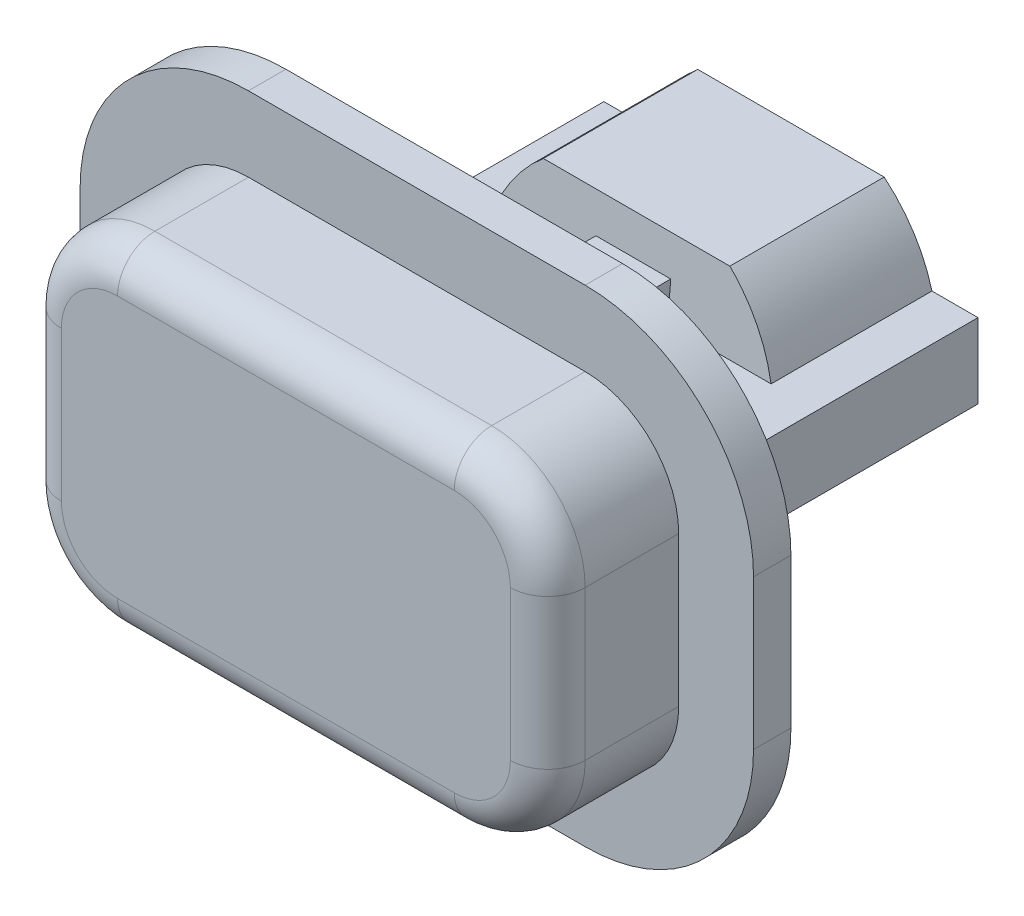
from build123d import *

# Parameters (mm, degrees)
EXTRUDE1_DEPTH     = 3.5
EXTRUDE2_DEPTH     = 1
FILLET1_R          = 1
SKETCH3_W          = 10
SKETCH3_H          = 2
EXTRUDE3_DEPTH     = 9
SKETCH4_W          = 2
SKETCH4_H          = 4
EXTRUDE4_DEPTH     = 9
SKETCH5_R          = 3.9
EXTRUDE5_DEPTH     = 4.3
SKETCH6_R          = 1.9
CUT_EXTRUDE1_DEPTH = 2
DRAFT1_ANGLE       = 5
DRAFT2_ANGLE       = 5
CUT_EXTRUDE2_REACH = 19.479
SKETCH7_W          = 8.421636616
SKETCH7_H          = 1.922330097


with BuildPart() as part:
    # Sketch1 → Extrude1 (new body)
    with BuildSketch(Plane.XY):
        with BuildLine():
            Line((-4.5, 4.5), (4.5, 4.5))
            ThreePointArc((4.5, 4.5), (6.267766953, 3.767766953), (7, 2))
            Line((7, 2), (7, -2))
            ThreePointArc((7, -2), (6.267766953, -3.767766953), (4.5, -4.5))
            Line((4.5, -4.5), (-4.5, -4.5))
            ThreePointArc((-4.5, -4.5), (-6.267766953, -3.767766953), (-7, -2))
            Line((-7, -2), (-7, 2))
            ThreePointArc((-7, 2), (-6.267766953, 3.767766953), (-4.5, 4.5))
        make_face()
    extrude(amount=-EXTRUDE1_DEPTH)

    # Sketch2 → Extrude2 (add)
    with BuildSketch(Plane(origin=(0, 0, -3.5), x_dir=(-1, 0, 0), z_dir=(0, 0, -1))):
        with BuildLine():
            Line((4.5, 6.5), (-4.5, 6.5))
            ThreePointArc((-4.5, 6.5), (-7.681980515, 5.181980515), (-9, 2))
            Line((-9, 2), (-9, -2))
            ThreePointArc((-9, -2), (-7.681980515, -5.181980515), (-4.5, -6.5))
            Line((-4.5, -6.5), (4.5, -6.5))
            ThreePointArc((4.5, -6.5), (7.681980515, -5.181980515), (9, -2))
            Line((9, -2), (9, 2))
            ThreePointArc((9, 2), (7.681980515, 5.181980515), (4.5, 6.5))
        make_face()
    extrude(amount=EXTRUDE2_DEPTH)

    # Fillet1
    fillet1_edges = [part.edges().sort_by_distance(p)[0] for p in [
        (-7, 0, 0),
        (-6.267766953, 3.767766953, 0),
        (0, 4.5, 0),
        (6.267766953, 3.767766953, 0),
        (7, 0, 0),
        (6.267766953, -3.767766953, 0),
        (0, -4.5, 0),
        (-6.267766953, -3.767766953, 0),
    ]]
    fillet(fillet1_edges, radius=FILLET1_R)

    # Sketch3 → Extrude3 (add)
    with BuildSketch(Plane(origin=(0, 0, -4.5), x_dir=(-1, 0, 0), z_dir=(0, 0, -1))):
        Rectangle(SKETCH3_W, SKETCH3_H)
    extrude(amount=EXTRUDE3_DEPTH)

    # Sketch4 → Extrude4 (add)
    with BuildSketch(Plane(origin=(0, 0, -4.5), x_dir=(-1, 0, 0), z_dir=(0, 0, -1))):
        Rectangle(SKETCH4_W, SKETCH4_H)
    extrude(amount=EXTRUDE4_DEPTH)

    # Sketch5 → Extrude5 (add)
    with BuildSketch(Plane(origin=(0, 0, -9.2), x_dir=(-1, 0, 0), z_dir=(0, 0, -1))):
        Circle(SKETCH5_R)
    extrude(amount=EXTRUDE5_DEPTH)

    # Sketch6 → Cut-Extrude1 (cut)
    with BuildSketch(Plane(origin=(0, 0, -13.5), x_dir=(-1, 0, 0), z_dir=(0, 0, -1))):
        Circle(SKETCH6_R)
    extrude(amount=-CUT_EXTRUDE1_DEPTH, mode=Mode.SUBTRACT)

    # Draft1
    draft1_faces = [part.faces().sort_by_distance(p)[0] for p in [
        (0, 2.307129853, -9.2),
    ]]
    draft(draft1_faces, Plane(origin=(5, 1, -13.5), x_dir=(1, 0, 0), z_dir=(0, 1, 0)), DRAFT1_ANGLE)

    # Draft2
    draft2_faces = [part.faces().sort_by_distance(p)[0] for p in [
        (0, -2.307129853, -9.2),
    ]]
    draft(draft2_faces, Plane(origin=(5, -1, -13.5), x_dir=(0, 0, -1), z_dir=(0, -1, 0)), DRAFT2_ANGLE)

    # Cut-Extrude2: up to this plane
    cut_extrude2_end = Plane(origin=(5, 1, -9.2), z_dir=(0, 0.08715574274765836, 0.9961946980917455))
    # Sketch7 → Cut-Extrude2 (cut, up to the surface)
    with BuildSketch(Plane(origin=(0, 0, -13.5), x_dir=(-1, 0, 0), z_dir=(0, 0, -1)), mode=Mode.PRIVATE) as cut_extrude2_sk1:
        with Locations((-0.07628294, 3.961165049)):
            Rectangle(SKETCH7_W, SKETCH7_H)
    cut_extrude2_tool1 = split(extrude(cut_extrude2_sk1.sketch, amount=-CUT_EXTRUDE2_REACH, mode=Mode.PRIVATE), bisect_by=cut_extrude2_end, keep=Keep.BOTH, mode=Mode.PRIVATE)
    add(cut_extrude2_tool1.solids().sort_by_distance((0.076283, 3.961165, -13.5))[0], mode=Mode.SUBTRACT)


solid = part.part
